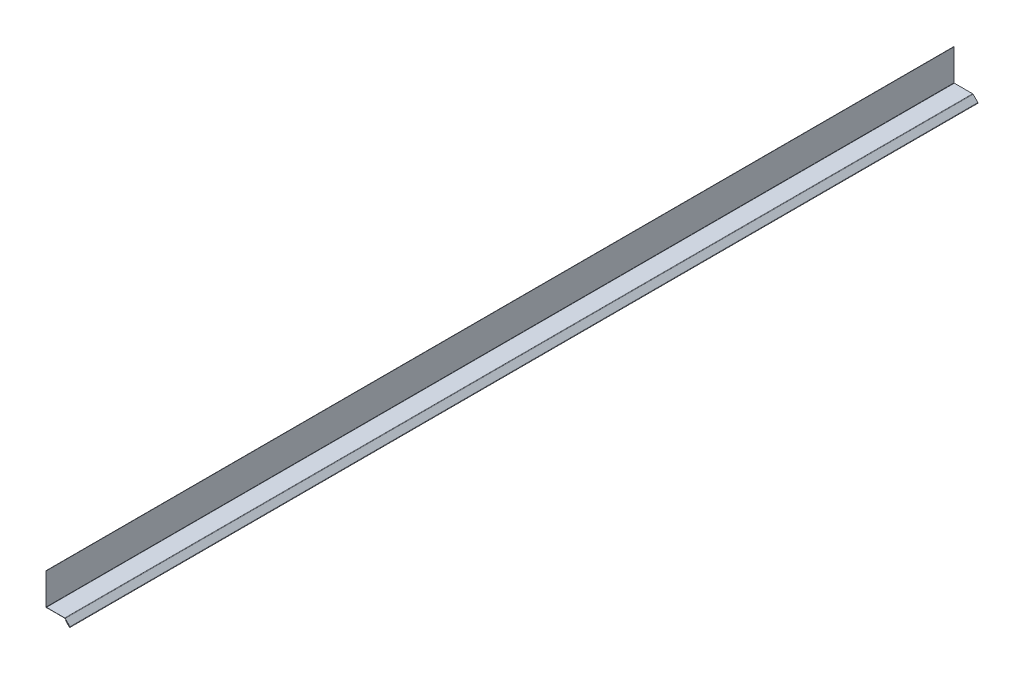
ISO-10303-21;
HEADER;
FILE_DESCRIPTION(('STEP AP214'),'2;1');
FILE_NAME('part.step','',(''),(''),'','','');
FILE_SCHEMA(('AUTOMOTIVE_DESIGN { 1 0 10303 214 1 1 1 1 }'));
ENDSEC;
DATA;
#1=APPLICATION_CONTEXT('core data for automotive mechanical design processes');
#2=APPLICATION_PROTOCOL_DEFINITION('international standard','automotive_design',2000,#1);
#3=PRODUCT_CONTEXT('',#1,'mechanical');
#4=PRODUCT('Part','Part','',(#3));
#5=PRODUCT_RELATED_PRODUCT_CATEGORY('part','',(#4));
#6=PRODUCT_DEFINITION_FORMATION('','',#4);
#7=PRODUCT_DEFINITION_CONTEXT('part definition',#1,'design');
#8=PRODUCT_DEFINITION('design','',#6,#7);
#9=PRODUCT_DEFINITION_SHAPE('','',#8);
#10=(LENGTH_UNIT() NAMED_UNIT(*) SI_UNIT(.MILLI.,.METRE.));
#11=(NAMED_UNIT(*) PLANE_ANGLE_UNIT() SI_UNIT($,.RADIAN.));
#12=(NAMED_UNIT(*) SI_UNIT($,.STERADIAN.) SOLID_ANGLE_UNIT());
#13=UNCERTAINTY_MEASURE_WITH_UNIT(LENGTH_MEASURE(1.E-05),#10,'distance_accuracy_value','');
#14=(GEOMETRIC_REPRESENTATION_CONTEXT(3) GLOBAL_UNCERTAINTY_ASSIGNED_CONTEXT((#13)) GLOBAL_UNIT_ASSIGNED_CONTEXT((#10,
#11,#12)) REPRESENTATION_CONTEXT('',''));
#15=CARTESIAN_POINT('',(0.,0.,0.));
#16=DIRECTION('',(0.,0.,1.));
#17=DIRECTION('',(1.,0.,0.));
#18=AXIS2_PLACEMENT_3D('',#15,#16,#17);
#19=CARTESIAN_POINT('',(51.7988702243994,-11.5172428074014,2000.));
#20=DIRECTION('',(-0.707106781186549,-0.707106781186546,0.));
#21=DIRECTION('',(0.707106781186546,-0.707106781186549,0.));
#22=AXIS2_PLACEMENT_3D('',#19,#20,#21);
#23=PLANE('',#22);
#24=DIRECTION('',(-0.707106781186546,0.707106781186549,0.));
#25=VECTOR('',#24,1.);
#26=CARTESIAN_POINT('',(51.7988702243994,-11.5172428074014,0.));
#27=LINE('',#26,#25);
#28=CARTESIAN_POINT('',(51.7988702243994,-11.5172428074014,0.));
#29=VERTEX_POINT('',#28);
#30=CARTESIAN_POINT('',(43.5313777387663,-3.2497503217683,0.));
#31=VERTEX_POINT('',#30);
#32=EDGE_CURVE('E180',#29,#31,#27,.T.);
#33=ORIENTED_EDGE('',*,*,#32,.T.);
#34=DIRECTION('',(0.,0.,-1.));
#35=VECTOR('',#34,1.);
#36=CARTESIAN_POINT('',(43.5313777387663,-3.2497503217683,2000.));
#37=LINE('',#36,#35);
#38=CARTESIAN_POINT('',(43.5313777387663,-3.2497503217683,2000.));
#39=VERTEX_POINT('',#38);
#40=EDGE_CURVE('E11',#39,#31,#37,.T.);
#41=ORIENTED_EDGE('',*,*,#40,.F.);
#42=DIRECTION('',(-0.707106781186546,0.707106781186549,0.));
#43=VECTOR('',#42,1.);
#44=CARTESIAN_POINT('',(51.7988702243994,-11.5172428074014,2000.));
#45=LINE('',#44,#43);
#46=CARTESIAN_POINT('',(51.7988702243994,-11.5172428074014,2000.));
#47=VERTEX_POINT('',#46);
#48=EDGE_CURVE('E117',#47,#39,#45,.T.);
#49=ORIENTED_EDGE('',*,*,#48,.F.);
#50=DIRECTION('',(0.,0.,-1.));
#51=VECTOR('',#50,1.);
#52=CARTESIAN_POINT('',(51.7988702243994,-11.5172428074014,2000.));
#53=LINE('',#52,#51);
#54=EDGE_CURVE('E176',#47,#29,#53,.T.);
#55=ORIENTED_EDGE('',*,*,#54,.T.);
#56=EDGE_LOOP('',(#33,#41,#49,#55));
#57=FACE_BOUND('',#56,.T.);
#58=ADVANCED_FACE('F37',(#57),#23,.F.);
#59=CARTESIAN_POINT('',(43.1721674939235,-3.60896056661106,2000.));
#60=DIRECTION('',(-0.707106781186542,0.707106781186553,0.));
#61=DIRECTION('',(-0.707106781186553,-0.707106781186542,0.));
#62=AXIS2_PLACEMENT_3D('',#59,#60,#61);
#63=PLANE('',#62);
#64=DIRECTION('',(0.707106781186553,0.707106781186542,0.));
#65=VECTOR('',#64,1.);
#66=CARTESIAN_POINT('',(43.1721674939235,-3.60896056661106,0.));
#67=LINE('',#66,#65);
#68=CARTESIAN_POINT('',(43.1721674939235,-3.60896056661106,0.));
#69=VERTEX_POINT('',#68);
#70=EDGE_CURVE('E183',#69,#31,#67,.T.);
#71=ORIENTED_EDGE('',*,*,#70,.F.);
#72=DIRECTION('',(0.,0.,-1.));
#73=VECTOR('',#72,1.);
#74=CARTESIAN_POINT('',(43.1721674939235,-3.60896056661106,2000.));
#75=LINE('',#74,#73);
#76=CARTESIAN_POINT('',(43.1721674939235,-3.60896056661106,2000.));
#77=VERTEX_POINT('',#76);
#78=EDGE_CURVE('E45',#77,#69,#75,.T.);
#79=ORIENTED_EDGE('',*,*,#78,.F.);
#80=DIRECTION('',(0.707106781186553,0.707106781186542,0.));
#81=VECTOR('',#80,1.);
#82=CARTESIAN_POINT('',(43.1721674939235,-3.60896056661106,2000.));
#83=LINE('',#82,#81);
#84=EDGE_CURVE('E265',#77,#39,#83,.T.);
#85=ORIENTED_EDGE('',*,*,#84,.T.);
#86=ORIENTED_EDGE('',*,*,#40,.T.);
#87=EDGE_LOOP('',(#71,#79,#85,#86));
#88=FACE_BOUND('',#87,.T.);
#89=ADVANCED_FACE('F252',(#88),#63,.T.);
#90=CARTESIAN_POINT('',(51.4396599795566,-11.8764530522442,2000.));
#91=DIRECTION('',(-0.707106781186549,-0.707106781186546,0.));
#92=DIRECTION('',(0.707106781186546,-0.707106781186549,0.));
#93=AXIS2_PLACEMENT_3D('',#90,#91,#92);
#94=PLANE('',#93);
#95=DIRECTION('',(-0.707106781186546,0.707106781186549,0.));
#96=VECTOR('',#95,1.);
#97=CARTESIAN_POINT('',(51.4396599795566,-11.8764530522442,0.));
#98=LINE('',#97,#96);
#99=CARTESIAN_POINT('',(51.4396599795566,-11.8764530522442,0.));
#100=VERTEX_POINT('',#99);
#101=EDGE_CURVE('E186',#100,#69,#98,.T.);
#102=ORIENTED_EDGE('',*,*,#101,.F.);
#103=DIRECTION('',(0.,0.,-1.));
#104=VECTOR('',#103,1.);
#105=CARTESIAN_POINT('',(51.4396599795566,-11.8764530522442,2000.));
#106=LINE('',#105,#104);
#107=CARTESIAN_POINT('',(51.4396599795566,-11.8764530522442,2000.));
#108=VERTEX_POINT('',#107);
#109=EDGE_CURVE('E242',#108,#100,#106,.T.);
#110=ORIENTED_EDGE('',*,*,#109,.F.);
#111=DIRECTION('',(-0.707106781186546,0.707106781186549,0.));
#112=VECTOR('',#111,1.);
#113=CARTESIAN_POINT('',(51.4396599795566,-11.8764530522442,2000.));
#114=LINE('',#113,#112);
#115=EDGE_CURVE('E249',#108,#77,#114,.T.);
#116=ORIENTED_EDGE('',*,*,#115,.T.);
#117=ORIENTED_EDGE('',*,*,#78,.T.);
#118=EDGE_LOOP('',(#102,#110,#116,#117));
#119=FACE_BOUND('',#118,.T.);
#120=ADVANCED_FACE('F247',(#119),#94,.T.);
#121=CARTESIAN_POINT('',(52.1524236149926,-11.1636894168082,2000.));
#122=DIRECTION('',(0.,0.,-1.));
#123=DIRECTION('',(-1.,0.,0.));
#124=AXIS2_PLACEMENT_3D('',#121,#122,#123);
#125=CYLINDRICAL_SURFACE('',#124,1.00800000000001);
#126=CARTESIAN_POINT('',(52.1524236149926,-11.1636894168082,0.));
#127=DIRECTION('',(0.,0.,1.));
#128=DIRECTION('',(1.,0.,0.));
#129=AXIS2_PLACEMENT_3D('',#126,#127,#128);
#130=CIRCLE('',#129,1.00800000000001);
#131=CARTESIAN_POINT('',(52.8651872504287,-10.4509257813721,0.));
#132=VERTEX_POINT('',#131);
#133=EDGE_CURVE('E189',#132,#100,#130,.F.);
#134=ORIENTED_EDGE('',*,*,#133,.F.);
#135=DIRECTION('',(0.,0.,-1.));
#136=VECTOR('',#135,1.);
#137=CARTESIAN_POINT('',(52.8651872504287,-10.4509257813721,2000.));
#138=LINE('',#137,#136);
#139=CARTESIAN_POINT('',(52.8651872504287,-10.4509257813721,2000.));
#140=VERTEX_POINT('',#139);
#141=EDGE_CURVE('E240',#140,#132,#138,.T.);
#142=ORIENTED_EDGE('',*,*,#141,.F.);
#143=CARTESIAN_POINT('',(52.1524236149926,-11.1636894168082,2000.));
#144=DIRECTION('',(0.,0.,1.));
#145=DIRECTION('',(1.,0.,0.));
#146=AXIS2_PLACEMENT_3D('',#143,#144,#145);
#147=CIRCLE('',#146,1.00800000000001);
#148=EDGE_CURVE('E262',#140,#108,#147,.F.);
#149=ORIENTED_EDGE('',*,*,#148,.T.);
#150=ORIENTED_EDGE('',*,*,#109,.T.);
#151=EDGE_LOOP('',(#134,#142,#149,#150));
#152=FACE_BOUND('',#151,.T.);
#153=ADVANCED_FACE('F259',(#152),#125,.T.);
#154=CARTESIAN_POINT('',(42.3526307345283,0.0616307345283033,2000.));
#155=DIRECTION('',(0.707106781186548,0.707106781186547,0.));
#156=DIRECTION('',(-0.707106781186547,0.707106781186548,0.));
#157=AXIS2_PLACEMENT_3D('',#154,#155,#156);
#158=PLANE('',#157);
#159=DIRECTION('',(0.707106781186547,-0.707106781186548,0.));
#160=VECTOR('',#159,1.);
#161=CARTESIAN_POINT('',(42.3526307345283,0.0616307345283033,0.));
#162=LINE('',#161,#160);
#163=CARTESIAN_POINT('',(42.3526307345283,0.0616307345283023,0.));
#164=VERTEX_POINT('',#163);
#165=EDGE_CURVE('E192',#164,#132,#162,.T.);
#166=ORIENTED_EDGE('',*,*,#165,.F.);
#167=DIRECTION('',(0.,0.,-1.));
#168=VECTOR('',#167,1.);
#169=CARTESIAN_POINT('',(42.3526307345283,0.0616307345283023,2000.));
#170=LINE('',#169,#168);
#171=CARTESIAN_POINT('',(42.3526307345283,0.0616307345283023,2000.));
#172=VERTEX_POINT('',#171);
#173=EDGE_CURVE('E238',#172,#164,#170,.T.);
#174=ORIENTED_EDGE('',*,*,#173,.F.);
#175=DIRECTION('',(0.707106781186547,-0.707106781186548,0.));
#176=VECTOR('',#175,1.);
#177=CARTESIAN_POINT('',(42.3526307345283,0.0616307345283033,2000.));
#178=LINE('',#177,#176);
#179=EDGE_CURVE('E267',#172,#140,#178,.T.);
#180=ORIENTED_EDGE('',*,*,#179,.T.);
#181=ORIENTED_EDGE('',*,*,#141,.T.);
#182=EDGE_LOOP('',(#166,#174,#180,#181));
#183=FACE_BOUND('',#182,.T.);
#184=ADVANCED_FACE('F324',(#183),#158,.T.);
#185=CARTESIAN_POINT('',(41.275,-1.016,2000.));
#186=DIRECTION('',(0.,0.,-1.));
#187=DIRECTION('',(-1.,0.,0.));
#188=AXIS2_PLACEMENT_3D('',#185,#186,#187);
#189=CYLINDRICAL_SURFACE('',#188,1.524);
#190=CARTESIAN_POINT('',(41.275,-1.016,0.));
#191=DIRECTION('',(0.,0.,1.));
#192=DIRECTION('',(1.,0.,0.));
#193=AXIS2_PLACEMENT_3D('',#190,#191,#192);
#194=CIRCLE('',#193,1.524);
#195=CARTESIAN_POINT('',(41.275,0.508000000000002,0.));
#196=VERTEX_POINT('',#195);
#197=EDGE_CURVE('E195',#196,#164,#194,.F.);
#198=ORIENTED_EDGE('',*,*,#197,.F.);
#199=DIRECTION('',(0.,0.,-1.));
#200=VECTOR('',#199,1.);
#201=CARTESIAN_POINT('',(41.275,0.508000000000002,2000.));
#202=LINE('',#201,#200);
#203=CARTESIAN_POINT('',(41.275,0.508000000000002,2000.));
#204=VERTEX_POINT('',#203);
#205=EDGE_CURVE('E236',#204,#196,#202,.T.);
#206=ORIENTED_EDGE('',*,*,#205,.F.);
#207=CARTESIAN_POINT('',(41.275,-1.016,2000.));
#208=DIRECTION('',(0.,0.,1.));
#209=DIRECTION('',(1.,0.,0.));
#210=AXIS2_PLACEMENT_3D('',#207,#208,#209);
#211=CIRCLE('',#210,1.524);
#212=EDGE_CURVE('E273',#204,#172,#211,.F.);
#213=ORIENTED_EDGE('',*,*,#212,.T.);
#214=ORIENTED_EDGE('',*,*,#173,.T.);
#215=EDGE_LOOP('',(#198,#206,#213,#214));
#216=FACE_BOUND('',#215,.T.);
#217=ADVANCED_FACE('F327',(#216),#189,.T.);
#218=CARTESIAN_POINT('',(1.,0.508,2000.));
#219=DIRECTION('',(0.,1.,0.));
#220=DIRECTION('',(0.,0.,1.));
#221=AXIS2_PLACEMENT_3D('',#218,#219,#220);
#222=PLANE('',#221);
#223=DIRECTION('',(1.,0.,0.));
#224=VECTOR('',#223,1.);
#225=CARTESIAN_POINT('',(1.,0.508,0.));
#226=LINE('',#225,#224);
#227=CARTESIAN_POINT('',(1.,0.508,0.));
#228=VERTEX_POINT('',#227);
#229=EDGE_CURVE('E198',#228,#196,#226,.T.);
#230=ORIENTED_EDGE('',*,*,#229,.F.);
#231=DIRECTION('',(0.,0.,-1.));
#232=VECTOR('',#231,1.);
#233=CARTESIAN_POINT('',(1.,0.508,2000.));
#234=LINE('',#233,#232);
#235=CARTESIAN_POINT('',(1.,0.508,2000.));
#236=VERTEX_POINT('',#235);
#237=EDGE_CURVE('E234',#236,#228,#234,.T.);
#238=ORIENTED_EDGE('',*,*,#237,.F.);
#239=DIRECTION('',(1.,0.,0.));
#240=VECTOR('',#239,1.);
#241=CARTESIAN_POINT('',(1.,0.508,2000.));
#242=LINE('',#241,#240);
#243=EDGE_CURVE('E276',#236,#204,#242,.T.);
#244=ORIENTED_EDGE('',*,*,#243,.T.);
#245=ORIENTED_EDGE('',*,*,#205,.T.);
#246=EDGE_LOOP('',(#230,#238,#244,#245));
#247=FACE_BOUND('',#246,.T.);
#248=ADVANCED_FACE('F331',(#247),#222,.T.);
#249=CARTESIAN_POINT('',(1.,1.,2000.));
#250=DIRECTION('',(0.,0.,-1.));
#251=DIRECTION('',(-1.,0.,0.));
#252=AXIS2_PLACEMENT_3D('',#249,#250,#251);
#253=CYLINDRICAL_SURFACE('',#252,0.492);
#254=CARTESIAN_POINT('',(1.,1.,0.));
#255=DIRECTION('',(0.,0.,1.));
#256=DIRECTION('',(1.,0.,0.));
#257=AXIS2_PLACEMENT_3D('',#254,#255,#256);
#258=CIRCLE('',#257,0.492);
#259=CARTESIAN_POINT('',(0.508,1.,0.));
#260=VERTEX_POINT('',#259);
#261=EDGE_CURVE('E201',#260,#228,#258,.T.);
#262=ORIENTED_EDGE('',*,*,#261,.F.);
#263=DIRECTION('',(0.,0.,-1.));
#264=VECTOR('',#263,1.);
#265=CARTESIAN_POINT('',(0.508,1.,2000.));
#266=LINE('',#265,#264);
#267=CARTESIAN_POINT('',(0.508,1.,2000.));
#268=VERTEX_POINT('',#267);
#269=EDGE_CURVE('E232',#268,#260,#266,.T.);
#270=ORIENTED_EDGE('',*,*,#269,.F.);
#271=CARTESIAN_POINT('',(1.,1.,2000.));
#272=DIRECTION('',(0.,0.,1.));
#273=DIRECTION('',(1.,0.,0.));
#274=AXIS2_PLACEMENT_3D('',#271,#272,#273);
#275=CIRCLE('',#274,0.492);
#276=EDGE_CURVE('E279',#268,#236,#275,.T.);
#277=ORIENTED_EDGE('',*,*,#276,.T.);
#278=ORIENTED_EDGE('',*,*,#237,.T.);
#279=EDGE_LOOP('',(#262,#270,#277,#278));
#280=FACE_BOUND('',#279,.T.);
#281=ADVANCED_FACE('F335',(#280),#253,.F.);
#282=CARTESIAN_POINT('',(0.508,1.,2000.));
#283=DIRECTION('',(1.,0.,0.));
#284=DIRECTION('',(0.,0.,-1.));
#285=AXIS2_PLACEMENT_3D('',#282,#283,#284);
#286=PLANE('',#285);
#287=DIRECTION('',(0.,1.,0.));
#288=VECTOR('',#287,1.);
#289=CARTESIAN_POINT('',(0.508,1.,0.));
#290=LINE('',#289,#288);
#291=CARTESIAN_POINT('',(0.508,69.85,0.));
#292=VERTEX_POINT('',#291);
#293=EDGE_CURVE('E204',#292,#260,#290,.F.);
#294=ORIENTED_EDGE('',*,*,#293,.F.);
#295=DIRECTION('',(0.,0.,-1.));
#296=VECTOR('',#295,1.);
#297=CARTESIAN_POINT('',(0.508,69.85,2000.));
#298=LINE('',#297,#296);
#299=CARTESIAN_POINT('',(0.508,69.85,2000.));
#300=VERTEX_POINT('',#299);
#301=EDGE_CURVE('E230',#300,#292,#298,.T.);
#302=ORIENTED_EDGE('',*,*,#301,.F.);
#303=DIRECTION('',(0.,1.,0.));
#304=VECTOR('',#303,1.);
#305=CARTESIAN_POINT('',(0.508,1.,2000.));
#306=LINE('',#305,#304);
#307=EDGE_CURVE('E282',#300,#268,#306,.F.);
#308=ORIENTED_EDGE('',*,*,#307,.T.);
#309=ORIENTED_EDGE('',*,*,#269,.T.);
#310=EDGE_LOOP('',(#294,#302,#308,#309));
#311=FACE_BOUND('',#310,.T.);
#312=ADVANCED_FACE('F339',(#311),#286,.T.);
#313=CARTESIAN_POINT('',(0.,69.85,2000.));
#314=DIRECTION('',(0.,1.,0.));
#315=DIRECTION('',(0.,0.,1.));
#316=AXIS2_PLACEMENT_3D('',#313,#314,#315);
#317=PLANE('',#316);
#318=DIRECTION('',(1.,0.,0.));
#319=VECTOR('',#318,1.);
#320=CARTESIAN_POINT('',(0.,69.85,0.));
#321=LINE('',#320,#319);
#322=CARTESIAN_POINT('',(0.,69.85,0.));
#323=VERTEX_POINT('',#322);
#324=EDGE_CURVE('E207',#323,#292,#321,.T.);
#325=ORIENTED_EDGE('',*,*,#324,.F.);
#326=DIRECTION('',(0.,0.,-1.));
#327=VECTOR('',#326,1.);
#328=CARTESIAN_POINT('',(0.,69.85,2000.));
#329=LINE('',#328,#327);
#330=CARTESIAN_POINT('',(0.,69.85,2000.));
#331=VERTEX_POINT('',#330);
#332=EDGE_CURVE('E228',#331,#323,#329,.T.);
#333=ORIENTED_EDGE('',*,*,#332,.F.);
#334=DIRECTION('',(1.,0.,0.));
#335=VECTOR('',#334,1.);
#336=CARTESIAN_POINT('',(0.,69.85,2000.));
#337=LINE('',#336,#335);
#338=EDGE_CURVE('E285',#331,#300,#337,.T.);
#339=ORIENTED_EDGE('',*,*,#338,.T.);
#340=ORIENTED_EDGE('',*,*,#301,.T.);
#341=EDGE_LOOP('',(#325,#333,#339,#340));
#342=FACE_BOUND('',#341,.T.);
#343=ADVANCED_FACE('F343',(#342),#317,.T.);
#344=CARTESIAN_POINT('',(0.,1.,2000.));
#345=DIRECTION('',(1.,0.,0.));
#346=DIRECTION('',(0.,0.,-1.));
#347=AXIS2_PLACEMENT_3D('',#344,#345,#346);
#348=PLANE('',#347);
#349=DIRECTION('',(0.,-1.,0.));
#350=VECTOR('',#349,1.);
#351=CARTESIAN_POINT('',(0.,1.,0.));
#352=LINE('',#351,#350);
#353=CARTESIAN_POINT('',(0.,1.,0.));
#354=VERTEX_POINT('',#353);
#355=EDGE_CURVE('E210',#323,#354,#352,.T.);
#356=ORIENTED_EDGE('',*,*,#355,.T.);
#357=DIRECTION('',(0.,0.,-1.));
#358=VECTOR('',#357,1.);
#359=CARTESIAN_POINT('',(0.,1.,2000.));
#360=LINE('',#359,#358);
#361=CARTESIAN_POINT('',(0.,1.,2000.));
#362=VERTEX_POINT('',#361);
#363=EDGE_CURVE('E225',#362,#354,#360,.T.);
#364=ORIENTED_EDGE('',*,*,#363,.F.);
#365=DIRECTION('',(0.,-1.,0.));
#366=VECTOR('',#365,1.);
#367=CARTESIAN_POINT('',(0.,1.,2000.));
#368=LINE('',#367,#366);
#369=EDGE_CURVE('E288',#331,#362,#368,.T.);
#370=ORIENTED_EDGE('',*,*,#369,.F.);
#371=ORIENTED_EDGE('',*,*,#332,.T.);
#372=EDGE_LOOP('',(#356,#364,#370,#371));
#373=FACE_BOUND('',#372,.T.);
#374=ADVANCED_FACE('F347',(#373),#348,.F.);
#375=CARTESIAN_POINT('',(1.,1.,2000.));
#376=DIRECTION('',(0.,0.,-1.));
#377=DIRECTION('',(-1.,0.,0.));
#378=AXIS2_PLACEMENT_3D('',#375,#376,#377);
#379=CYLINDRICAL_SURFACE('',#378,1.);
#380=CARTESIAN_POINT('',(1.,1.,0.));
#381=DIRECTION('',(0.,0.,1.));
#382=DIRECTION('',(1.,0.,0.));
#383=AXIS2_PLACEMENT_3D('',#380,#381,#382);
#384=CIRCLE('',#383,1.);
#385=CARTESIAN_POINT('',(1.,0.,0.));
#386=VERTEX_POINT('',#385);
#387=EDGE_CURVE('E212',#354,#386,#384,.T.);
#388=ORIENTED_EDGE('',*,*,#387,.T.);
#389=DIRECTION('',(0.,0.,-1.));
#390=VECTOR('',#389,1.);
#391=CARTESIAN_POINT('',(1.,0.,2000.));
#392=LINE('',#391,#390);
#393=CARTESIAN_POINT('',(1.,0.,2000.));
#394=VERTEX_POINT('',#393);
#395=EDGE_CURVE('E222',#394,#386,#392,.T.);
#396=ORIENTED_EDGE('',*,*,#395,.F.);
#397=CARTESIAN_POINT('',(1.,1.,2000.));
#398=DIRECTION('',(0.,0.,1.));
#399=DIRECTION('',(1.,0.,0.));
#400=AXIS2_PLACEMENT_3D('',#397,#398,#399);
#401=CIRCLE('',#400,1.);
#402=EDGE_CURVE('E290',#362,#394,#401,.T.);
#403=ORIENTED_EDGE('',*,*,#402,.F.);
#404=ORIENTED_EDGE('',*,*,#363,.T.);
#405=EDGE_LOOP('',(#388,#396,#403,#404));
#406=FACE_BOUND('',#405,.T.);
#407=ADVANCED_FACE('F297',(#406),#379,.T.);
#408=CARTESIAN_POINT('',(1.,0.,2000.));
#409=DIRECTION('',(0.,1.,0.));
#410=DIRECTION('',(0.,0.,1.));
#411=AXIS2_PLACEMENT_3D('',#408,#409,#410);
#412=PLANE('',#411);
#413=DIRECTION('',(1.,0.,0.));
#414=VECTOR('',#413,1.);
#415=CARTESIAN_POINT('',(1.,0.,0.));
#416=LINE('',#415,#414);
#417=CARTESIAN_POINT('',(41.275,0.,0.));
#418=VERTEX_POINT('',#417);
#419=EDGE_CURVE('E214',#386,#418,#416,.T.);
#420=ORIENTED_EDGE('',*,*,#419,.T.);
#421=DIRECTION('',(0.,0.,-1.));
#422=VECTOR('',#421,1.);
#423=CARTESIAN_POINT('',(41.275,0.,2000.));
#424=LINE('',#423,#422);
#425=CARTESIAN_POINT('',(41.275,0.,2000.));
#426=VERTEX_POINT('',#425);
#427=EDGE_CURVE('E171',#426,#418,#424,.T.);
#428=ORIENTED_EDGE('',*,*,#427,.F.);
#429=DIRECTION('',(1.,0.,0.));
#430=VECTOR('',#429,1.);
#431=CARTESIAN_POINT('',(1.,0.,2000.));
#432=LINE('',#431,#430);
#433=EDGE_CURVE('E162',#394,#426,#432,.T.);
#434=ORIENTED_EDGE('',*,*,#433,.F.);
#435=ORIENTED_EDGE('',*,*,#395,.T.);
#436=EDGE_LOOP('',(#420,#428,#434,#435));
#437=FACE_BOUND('',#436,.T.);
#438=ADVANCED_FACE('F301',(#437),#412,.F.);
#439=CARTESIAN_POINT('',(41.275,-1.016,2000.));
#440=DIRECTION('',(0.,0.,-1.));
#441=DIRECTION('',(-1.,0.,0.));
#442=AXIS2_PLACEMENT_3D('',#439,#440,#441);
#443=CYLINDRICAL_SURFACE('',#442,1.016);
#444=CARTESIAN_POINT('',(41.275,-1.016,0.));
#445=DIRECTION('',(0.,0.,-1.));
#446=DIRECTION('',(1.,0.,0.));
#447=AXIS2_PLACEMENT_3D('',#444,#445,#446);
#448=CIRCLE('',#447,1.016);
#449=CARTESIAN_POINT('',(41.9934204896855,-0.297579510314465,0.));
#450=VERTEX_POINT('',#449);
#451=EDGE_CURVE('E170',#418,#450,#448,.T.);
#452=ORIENTED_EDGE('',*,*,#451,.T.);
#453=DIRECTION('',(0.,0.,-1.));
#454=VECTOR('',#453,1.);
#455=CARTESIAN_POINT('',(41.9934204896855,-0.297579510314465,2000.));
#456=LINE('',#455,#454);
#457=CARTESIAN_POINT('',(41.9934204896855,-0.297579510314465,2000.));
#458=VERTEX_POINT('',#457);
#459=EDGE_CURVE('E167',#458,#450,#456,.T.);
#460=ORIENTED_EDGE('',*,*,#459,.F.);
#461=CARTESIAN_POINT('',(41.275,-1.016,2000.));
#462=DIRECTION('',(0.,0.,-1.));
#463=DIRECTION('',(1.,0.,0.));
#464=AXIS2_PLACEMENT_3D('',#461,#462,#463);
#465=CIRCLE('',#464,1.016);
#466=EDGE_CURVE('E156',#426,#458,#465,.T.);
#467=ORIENTED_EDGE('',*,*,#466,.F.);
#468=ORIENTED_EDGE('',*,*,#427,.T.);
#469=EDGE_LOOP('',(#452,#460,#467,#468));
#470=FACE_BOUND('',#469,.T.);
#471=ADVANCED_FACE('F168',(#470),#443,.F.);
#472=CARTESIAN_POINT('',(41.9934204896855,-0.297579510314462,2000.));
#473=DIRECTION('',(0.707106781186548,0.707106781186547,0.));
#474=DIRECTION('',(-0.707106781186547,0.707106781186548,0.));
#475=AXIS2_PLACEMENT_3D('',#472,#473,#474);
#476=PLANE('',#475);
#477=DIRECTION('',(0.707106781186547,-0.707106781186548,0.));
#478=VECTOR('',#477,1.);
#479=CARTESIAN_POINT('',(41.9934204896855,-0.297579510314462,0.));
#480=LINE('',#479,#478);
#481=CARTESIAN_POINT('',(52.5059770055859,-10.8101360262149,0.));
#482=VERTEX_POINT('',#481);
#483=EDGE_CURVE('E105',#450,#482,#480,.T.);
#484=ORIENTED_EDGE('',*,*,#483,.T.);
#485=DIRECTION('',(0.,0.,-1.));
#486=VECTOR('',#485,1.);
#487=CARTESIAN_POINT('',(52.5059770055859,-10.8101360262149,2000.));
#488=LINE('',#487,#486);
#489=CARTESIAN_POINT('',(52.5059770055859,-10.8101360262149,2000.));
#490=VERTEX_POINT('',#489);
#491=EDGE_CURVE('E172',#490,#482,#488,.T.);
#492=ORIENTED_EDGE('',*,*,#491,.F.);
#493=DIRECTION('',(0.707106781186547,-0.707106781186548,0.));
#494=VECTOR('',#493,1.);
#495=CARTESIAN_POINT('',(41.9934204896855,-0.297579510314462,2000.));
#496=LINE('',#495,#494);
#497=EDGE_CURVE('E160',#458,#490,#496,.T.);
#498=ORIENTED_EDGE('',*,*,#497,.F.);
#499=ORIENTED_EDGE('',*,*,#459,.T.);
#500=EDGE_LOOP('',(#484,#492,#498,#499));
#501=FACE_BOUND('',#500,.T.);
#502=ADVANCED_FACE('F174',(#501),#476,.F.);
#503=CARTESIAN_POINT('',(52.1524236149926,-11.1636894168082,2000.));
#504=DIRECTION('',(0.,0.,-1.));
#505=DIRECTION('',(-1.,0.,0.));
#506=AXIS2_PLACEMENT_3D('',#503,#504,#505);
#507=CYLINDRICAL_SURFACE('',#506,0.500000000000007);
#508=CARTESIAN_POINT('',(52.1524236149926,-11.1636894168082,0.));
#509=DIRECTION('',(0.,0.,-1.));
#510=DIRECTION('',(-1.,0.,0.));
#511=AXIS2_PLACEMENT_3D('',#508,#509,#510);
#512=CIRCLE('',#511,0.500000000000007);
#513=EDGE_CURVE('E111',#482,#29,#512,.T.);
#514=ORIENTED_EDGE('',*,*,#513,.T.);
#515=ORIENTED_EDGE('',*,*,#54,.F.);
#516=CARTESIAN_POINT('',(52.1524236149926,-11.1636894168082,2000.));
#517=DIRECTION('',(0.,0.,-1.));
#518=DIRECTION('',(-1.,0.,0.));
#519=AXIS2_PLACEMENT_3D('',#516,#517,#518);
#520=CIRCLE('',#519,0.500000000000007);
#521=EDGE_CURVE('E53',#490,#47,#520,.T.);
#522=ORIENTED_EDGE('',*,*,#521,.F.);
#523=ORIENTED_EDGE('',*,*,#491,.T.);
#524=EDGE_LOOP('',(#514,#515,#522,#523));
#525=FACE_BOUND('',#524,.T.);
#526=ADVANCED_FACE('F303',(#525),#507,.F.);
#527=CARTESIAN_POINT('',(52.1524236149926,-11.1636894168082,2000.));
#528=DIRECTION('',(0.,0.,1.));
#529=DIRECTION('',(1.,0.,0.));
#530=AXIS2_PLACEMENT_3D('',#527,#528,#529);
#531=PLANE('',#530);
#532=ORIENTED_EDGE('',*,*,#48,.T.);
#533=ORIENTED_EDGE('',*,*,#84,.F.);
#534=ORIENTED_EDGE('',*,*,#115,.F.);
#535=ORIENTED_EDGE('',*,*,#148,.F.);
#536=ORIENTED_EDGE('',*,*,#179,.F.);
#537=ORIENTED_EDGE('',*,*,#212,.F.);
#538=ORIENTED_EDGE('',*,*,#243,.F.);
#539=ORIENTED_EDGE('',*,*,#276,.F.);
#540=ORIENTED_EDGE('',*,*,#307,.F.);
#541=ORIENTED_EDGE('',*,*,#338,.F.);
#542=ORIENTED_EDGE('',*,*,#369,.T.);
#543=ORIENTED_EDGE('',*,*,#402,.T.);
#544=ORIENTED_EDGE('',*,*,#433,.T.);
#545=ORIENTED_EDGE('',*,*,#466,.T.);
#546=ORIENTED_EDGE('',*,*,#497,.T.);
#547=ORIENTED_EDGE('',*,*,#521,.T.);
#548=EDGE_LOOP('',(#532,#533,#534,#535,#536,#537,#538,#539,#540,#541,#542,#543,#544,#545,#546,#547));
#549=FACE_BOUND('',#548,.T.);
#550=ADVANCED_FACE('F158',(#549),#531,.T.);
#551=CARTESIAN_POINT('',(52.1524236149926,-11.1636894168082,0.));
#552=DIRECTION('',(0.,0.,1.));
#553=DIRECTION('',(1.,0.,0.));
#554=AXIS2_PLACEMENT_3D('',#551,#552,#553);
#555=PLANE('',#554);
#556=ORIENTED_EDGE('',*,*,#32,.F.);
#557=ORIENTED_EDGE('',*,*,#513,.F.);
#558=ORIENTED_EDGE('',*,*,#483,.F.);
#559=ORIENTED_EDGE('',*,*,#451,.F.);
#560=ORIENTED_EDGE('',*,*,#419,.F.);
#561=ORIENTED_EDGE('',*,*,#387,.F.);
#562=ORIENTED_EDGE('',*,*,#355,.F.);
#563=ORIENTED_EDGE('',*,*,#324,.T.);
#564=ORIENTED_EDGE('',*,*,#293,.T.);
#565=ORIENTED_EDGE('',*,*,#261,.T.);
#566=ORIENTED_EDGE('',*,*,#229,.T.);
#567=ORIENTED_EDGE('',*,*,#197,.T.);
#568=ORIENTED_EDGE('',*,*,#165,.T.);
#569=ORIENTED_EDGE('',*,*,#133,.T.);
#570=ORIENTED_EDGE('',*,*,#101,.T.);
#571=ORIENTED_EDGE('',*,*,#70,.T.);
#572=EDGE_LOOP('',(#556,#557,#558,#559,#560,#561,#562,#563,#564,#565,#566,#567,#568,#569,#570,#571));
#573=FACE_BOUND('',#572,.T.);
#574=ADVANCED_FACE('F255',(#573),#555,.F.);
#575=CLOSED_SHELL('',(#58,#89,#120,#153,#184,#217,#248,#281,#312,#343,#374,#407,#438,#471,#502,
#526,#550,#574));
#576=MANIFOLD_SOLID_BREP('B2',#575);
#577=ADVANCED_BREP_SHAPE_REPRESENTATION('',(#18,#576),#14);
#578=SHAPE_DEFINITION_REPRESENTATION(#9,#577);
ENDSEC;
END-ISO-10303-21;
